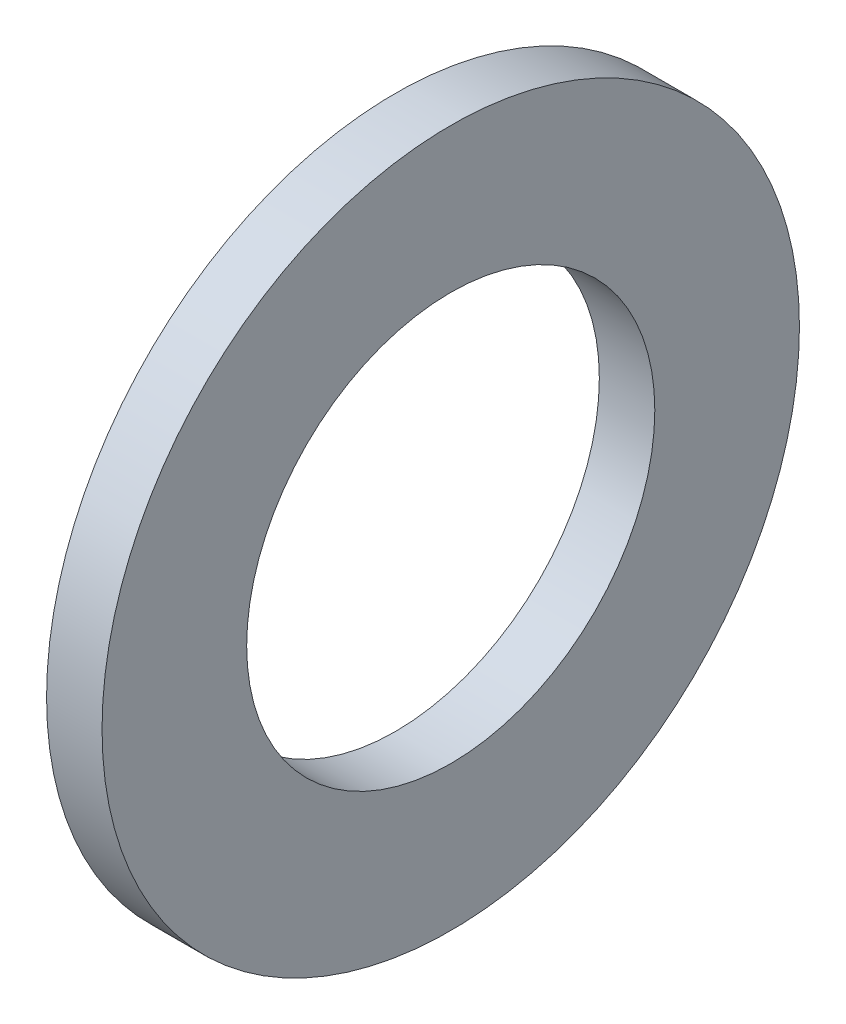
ISO-10303-21;
HEADER;
FILE_DESCRIPTION(('STEP AP214'),'2;1');
FILE_NAME('part.step','',(''),(''),'','','');
FILE_SCHEMA(('AUTOMOTIVE_DESIGN { 1 0 10303 214 1 1 1 1 }'));
ENDSEC;
DATA;
#1=APPLICATION_CONTEXT('core data for automotive mechanical design processes');
#2=APPLICATION_PROTOCOL_DEFINITION('international standard','automotive_design',2000,#1);
#3=PRODUCT_CONTEXT('',#1,'mechanical');
#4=PRODUCT('Part','Part','',(#3));
#5=PRODUCT_RELATED_PRODUCT_CATEGORY('part','',(#4));
#6=PRODUCT_DEFINITION_FORMATION('','',#4);
#7=PRODUCT_DEFINITION_CONTEXT('part definition',#1,'design');
#8=PRODUCT_DEFINITION('design','',#6,#7);
#9=PRODUCT_DEFINITION_SHAPE('','',#8);
#10=(LENGTH_UNIT() NAMED_UNIT(*) SI_UNIT(.MILLI.,.METRE.));
#11=(NAMED_UNIT(*) PLANE_ANGLE_UNIT() SI_UNIT($,.RADIAN.));
#12=(NAMED_UNIT(*) SI_UNIT($,.STERADIAN.) SOLID_ANGLE_UNIT());
#13=UNCERTAINTY_MEASURE_WITH_UNIT(LENGTH_MEASURE(1.E-05),#10,'distance_accuracy_value','');
#14=(GEOMETRIC_REPRESENTATION_CONTEXT(3) GLOBAL_UNCERTAINTY_ASSIGNED_CONTEXT((#13)) GLOBAL_UNIT_ASSIGNED_CONTEXT((#10,
#11,#12)) REPRESENTATION_CONTEXT('',''));
#15=CARTESIAN_POINT('',(0.,0.,0.));
#16=DIRECTION('',(0.,0.,1.));
#17=DIRECTION('',(1.,0.,0.));
#18=AXIS2_PLACEMENT_3D('',#15,#16,#17);
#19=CARTESIAN_POINT('',(1.778,0.,0.));
#20=DIRECTION('',(1.,0.,0.));
#21=DIRECTION('',(0.,0.,-1.));
#22=AXIS2_PLACEMENT_3D('',#19,#20,#21);
#23=PLANE('',#22);
#24=CARTESIAN_POINT('',(1.778,0.,0.));
#25=DIRECTION('',(1.,0.,0.));
#26=DIRECTION('',(0.,0.,-1.));
#27=AXIS2_PLACEMENT_3D('',#24,#25,#26);
#28=CIRCLE('',#27,11.176);
#29=CARTESIAN_POINT('',(1.778,0.,-11.176));
#30=VERTEX_POINT('',#29);
#31=EDGE_CURVE('E10',#30,#30,#28,.T.);
#32=ORIENTED_EDGE('',*,*,#31,.T.);
#33=EDGE_LOOP('',(#32));
#34=FACE_BOUND('',#33,.T.);
#35=CARTESIAN_POINT('',(1.778,0.,0.));
#36=DIRECTION('',(1.,0.,0.));
#37=DIRECTION('',(0.,0.,-1.));
#38=AXIS2_PLACEMENT_3D('',#35,#36,#37);
#39=CIRCLE('',#38,6.5405);
#40=CARTESIAN_POINT('',(1.778,0.,-6.5405));
#41=VERTEX_POINT('',#40);
#42=EDGE_CURVE('E47',#41,#41,#39,.T.);
#43=ORIENTED_EDGE('',*,*,#42,.F.);
#44=EDGE_LOOP('',(#43));
#45=FACE_BOUND('',#44,.T.);
#46=ADVANCED_FACE('F36',(#34,#45),#23,.T.);
#47=CARTESIAN_POINT('',(0.,0.,0.));
#48=DIRECTION('',(1.,0.,0.));
#49=DIRECTION('',(0.,0.,-1.));
#50=AXIS2_PLACEMENT_3D('',#47,#48,#49);
#51=PLANE('',#50);
#52=CARTESIAN_POINT('',(0.,0.,0.));
#53=DIRECTION('',(1.,0.,0.));
#54=DIRECTION('',(0.,0.,-1.));
#55=AXIS2_PLACEMENT_3D('',#52,#53,#54);
#56=CIRCLE('',#55,11.176);
#57=CARTESIAN_POINT('',(0.,0.,-11.176));
#58=VERTEX_POINT('',#57);
#59=EDGE_CURVE('E40',#58,#58,#56,.T.);
#60=ORIENTED_EDGE('',*,*,#59,.F.);
#61=EDGE_LOOP('',(#60));
#62=FACE_BOUND('',#61,.T.);
#63=CARTESIAN_POINT('',(0.,0.,0.));
#64=DIRECTION('',(1.,0.,0.));
#65=DIRECTION('',(0.,0.,-1.));
#66=AXIS2_PLACEMENT_3D('',#63,#64,#65);
#67=CIRCLE('',#66,6.5405);
#68=CARTESIAN_POINT('',(0.,0.,-6.5405));
#69=VERTEX_POINT('',#68);
#70=EDGE_CURVE('E49',#69,#69,#67,.T.);
#71=ORIENTED_EDGE('',*,*,#70,.T.);
#72=EDGE_LOOP('',(#71));
#73=FACE_BOUND('',#72,.T.);
#74=ADVANCED_FACE('F59',(#62,#73),#51,.F.);
#75=CARTESIAN_POINT('',(1.778,0.,0.));
#76=DIRECTION('',(-1.,0.,0.));
#77=DIRECTION('',(0.,0.,1.));
#78=AXIS2_PLACEMENT_3D('',#75,#76,#77);
#79=CYLINDRICAL_SURFACE('',#78,11.176);
#80=ORIENTED_EDGE('',*,*,#31,.F.);
#81=EDGE_LOOP('',(#80));
#82=FACE_BOUND('',#81,.T.);
#83=ORIENTED_EDGE('',*,*,#59,.T.);
#84=EDGE_LOOP('',(#83));
#85=FACE_BOUND('',#84,.T.);
#86=ADVANCED_FACE('F38',(#82,#85),#79,.T.);
#87=CARTESIAN_POINT('',(1.778,0.,0.));
#88=DIRECTION('',(-1.,0.,0.));
#89=DIRECTION('',(0.,0.,1.));
#90=AXIS2_PLACEMENT_3D('',#87,#88,#89);
#91=CYLINDRICAL_SURFACE('',#90,6.5405);
#92=ORIENTED_EDGE('',*,*,#42,.T.);
#93=EDGE_LOOP('',(#92));
#94=FACE_BOUND('',#93,.T.);
#95=ORIENTED_EDGE('',*,*,#70,.F.);
#96=EDGE_LOOP('',(#95));
#97=FACE_BOUND('',#96,.T.);
#98=ADVANCED_FACE('F55',(#94,#97),#91,.F.);
#99=CLOSED_SHELL('',(#46,#74,#86,#98));
#100=MANIFOLD_SOLID_BREP('B2',#99);
#101=ADVANCED_BREP_SHAPE_REPRESENTATION('',(#18,#100),#14);
#102=SHAPE_DEFINITION_REPRESENTATION(#9,#101);
ENDSEC;
END-ISO-10303-21;
